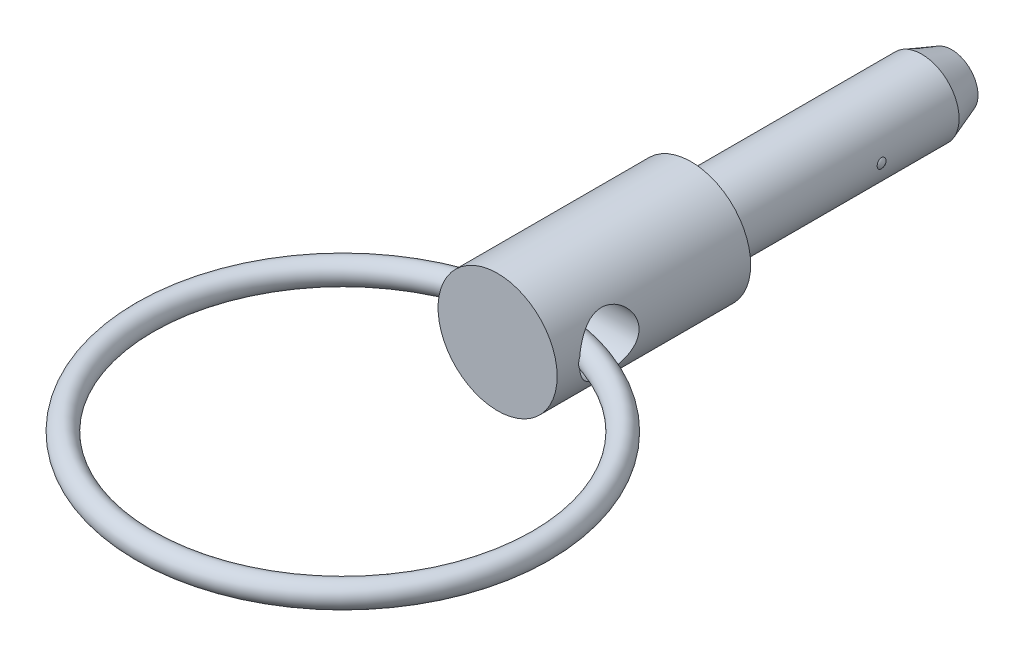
ISO-10303-21;
HEADER;
FILE_DESCRIPTION(('STEP AP214'),'2;1');
FILE_NAME('part.step','',(''),(''),'','','');
FILE_SCHEMA(('AUTOMOTIVE_DESIGN { 1 0 10303 214 1 1 1 1 }'));
ENDSEC;
DATA;
#1=APPLICATION_CONTEXT('core data for automotive mechanical design processes');
#2=APPLICATION_PROTOCOL_DEFINITION('international standard','automotive_design',2000,#1);
#3=PRODUCT_CONTEXT('',#1,'mechanical');
#4=PRODUCT('Part','Part','',(#3));
#5=PRODUCT_RELATED_PRODUCT_CATEGORY('part','',(#4));
#6=PRODUCT_DEFINITION_FORMATION('','',#4);
#7=PRODUCT_DEFINITION_CONTEXT('part definition',#1,'design');
#8=PRODUCT_DEFINITION('design','',#6,#7);
#9=PRODUCT_DEFINITION_SHAPE('','',#8);
#10=(LENGTH_UNIT() NAMED_UNIT(*) SI_UNIT(.MILLI.,.METRE.));
#11=(NAMED_UNIT(*) PLANE_ANGLE_UNIT() SI_UNIT($,.RADIAN.));
#12=(NAMED_UNIT(*) SI_UNIT($,.STERADIAN.) SOLID_ANGLE_UNIT());
#13=UNCERTAINTY_MEASURE_WITH_UNIT(LENGTH_MEASURE(1.E-05),#10,'distance_accuracy_value','');
#14=(GEOMETRIC_REPRESENTATION_CONTEXT(3) GLOBAL_UNCERTAINTY_ASSIGNED_CONTEXT((#13)) GLOBAL_UNIT_ASSIGNED_CONTEXT((#10,
#11,#12)) REPRESENTATION_CONTEXT('',''));
#15=CARTESIAN_POINT('',(0.,0.,0.));
#16=DIRECTION('',(0.,0.,1.));
#17=DIRECTION('',(1.,0.,0.));
#18=AXIS2_PLACEMENT_3D('',#15,#16,#17);
#19=CARTESIAN_POINT('',(0.,0.,14.9758741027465));
#20=DIRECTION('',(0.,0.,1.));
#21=DIRECTION('',(1.,0.,0.));
#22=AXIS2_PLACEMENT_3D('',#19,#20,#21);
#23=CYLINDRICAL_SURFACE('',#22,4.00000000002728);
#24=CARTESIAN_POINT('',(0.,0.,12.9999999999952));
#25=DIRECTION('',(0.,0.,1.));
#26=DIRECTION('',(1.,0.,0.));
#27=AXIS2_PLACEMENT_3D('',#24,#25,#26);
#28=CIRCLE('',#27,4.00000000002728);
#29=CARTESIAN_POINT('',(4.00000000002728,0.,12.9999999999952));
#30=VERTEX_POINT('',#29);
#31=EDGE_CURVE('E66',#30,#30,#28,.T.);
#32=ORIENTED_EDGE('',*,*,#31,.F.);
#33=EDGE_LOOP('',(#32));
#34=FACE_BOUND('',#33,.T.);
#35=CARTESIAN_POINT('',(0.,0.,2.90531487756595E-11));
#36=DIRECTION('',(0.,0.,1.));
#37=DIRECTION('',(1.,0.,0.));
#38=AXIS2_PLACEMENT_3D('',#35,#36,#37);
#39=CIRCLE('',#38,4.00000000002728);
#40=CARTESIAN_POINT('',(4.00000000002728,0.,2.90540174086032E-11));
#41=VERTEX_POINT('',#40);
#42=EDGE_CURVE('E123',#41,#41,#39,.T.);
#43=ORIENTED_EDGE('',*,*,#42,.T.);
#44=EDGE_LOOP('',(#43));
#45=FACE_BOUND('',#44,.T.);
#46=CARTESIAN_POINT('',(3.99005038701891,0.281953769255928,9.92986493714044));
#47=CARTESIAN_POINT('',(3.98710361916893,0.323646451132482,9.94537015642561));
#48=CARTESIAN_POINT('',(3.98358785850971,0.364031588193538,9.96435084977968));
#49=CARTESIAN_POINT('',(3.97580260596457,0.441017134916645,10.008790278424));
#50=CARTESIAN_POINT('',(3.97153248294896,0.477614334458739,10.0342544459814));
#51=CARTESIAN_POINT('',(3.96271650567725,0.545954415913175,10.0909789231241));
#52=CARTESIAN_POINT('',(3.95817071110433,0.577698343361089,10.1222379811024));
#53=CARTESIAN_POINT('',(3.94931125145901,0.635450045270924,10.1896824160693));
#54=CARTESIAN_POINT('',(3.94499753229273,0.661459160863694,10.2258666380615));
#55=CARTESIAN_POINT('',(3.93708131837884,0.707055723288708,10.3020868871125));
#56=CARTESIAN_POINT('',(3.93347801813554,0.726650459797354,10.3421184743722));
#57=CARTESIAN_POINT('',(3.92735611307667,0.759043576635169,10.4249158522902));
#58=CARTESIAN_POINT('',(3.92483759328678,0.7718414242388,10.4676818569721));
#59=CARTESIAN_POINT('',(3.92109281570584,0.790648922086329,10.5555243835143));
#60=CARTESIAN_POINT('',(3.91989028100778,0.796534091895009,10.6006284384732));
#61=CARTESIAN_POINT('',(3.91894269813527,0.801182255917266,10.6912124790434));
#62=CARTESIAN_POINT('',(3.919197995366,0.799943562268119,10.7366925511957));
#63=CARTESIAN_POINT('',(3.92114297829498,0.790356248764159,10.829192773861));
#64=CARTESIAN_POINT('',(3.92290466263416,0.781650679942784,10.8761742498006));
#65=CARTESIAN_POINT('',(3.92772482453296,0.757055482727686,10.9681516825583));
#66=CARTESIAN_POINT('',(3.93078377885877,0.74116321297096,11.0131469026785));
#67=CARTESIAN_POINT('',(3.93806499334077,0.701480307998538,11.1026764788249));
#68=CARTESIAN_POINT('',(3.94234583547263,0.67727451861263,11.1470226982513));
#69=CARTESIAN_POINT('',(3.95147153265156,0.621820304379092,11.2310343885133));
#70=CARTESIAN_POINT('',(3.95631656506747,0.590569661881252,11.2706983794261));
#71=CARTESIAN_POINT('',(3.96601819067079,0.521460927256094,11.3441933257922));
#72=CARTESIAN_POINT('',(3.97087472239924,0.483570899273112,11.3779944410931));
#73=CARTESIAN_POINT('',(3.97994547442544,0.402125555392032,11.4380257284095));
#74=CARTESIAN_POINT('',(3.98416017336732,0.358574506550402,11.4642615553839));
#75=CARTESIAN_POINT('',(3.99101820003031,0.271145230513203,11.5057266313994));
#76=CARTESIAN_POINT('',(3.99376828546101,0.227643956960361,11.5217298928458));
#77=CARTESIAN_POINT('',(3.99785545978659,0.138347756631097,11.5452375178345));
#78=CARTESIAN_POINT('',(3.99919394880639,0.0925551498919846,11.5527503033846));
#79=CARTESIAN_POINT('',(4.00020492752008,0.00564920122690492,11.5584330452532));
#80=CARTESIAN_POINT('',(4.00005022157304,-0.0354012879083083,11.5575719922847));
#81=CARTESIAN_POINT('',(3.99850330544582,-0.116721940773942,11.5488508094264));
#82=CARTESIAN_POINT('',(3.99711125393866,-0.156992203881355,11.5409915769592));
#83=CARTESIAN_POINT('',(3.99330536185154,-0.234470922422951,11.5190218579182));
#84=CARTESIAN_POINT('',(3.99092186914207,-0.271733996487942,11.5050965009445));
#85=CARTESIAN_POINT('',(3.98537855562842,-0.343596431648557,11.4716692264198));
#86=CARTESIAN_POINT('',(3.98221855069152,-0.378195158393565,11.4521659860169));
#87=CARTESIAN_POINT('',(3.97515535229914,-0.446551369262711,11.4066625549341));
#88=CARTESIAN_POINT('',(3.97121432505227,-0.480054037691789,11.380286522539));
#89=CARTESIAN_POINT('',(3.96314004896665,-0.542697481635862,11.3228119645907));
#90=CARTESIAN_POINT('',(3.95900671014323,-0.571836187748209,11.2917112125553));
#91=CARTESIAN_POINT('',(3.95044956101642,-0.628376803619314,11.2218573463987));
#92=CARTESIAN_POINT('',(3.94604615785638,-0.655204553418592,11.1826362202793));
#93=CARTESIAN_POINT('',(3.93791011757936,-0.702452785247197,11.1004353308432));
#94=CARTESIAN_POINT('',(3.93417778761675,-0.722870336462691,11.0574538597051));
#95=CARTESIAN_POINT('',(3.92755557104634,-0.758058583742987,10.9655943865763));
#96=CARTESIAN_POINT('',(3.92474503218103,-0.772320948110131,10.9165145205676));
#97=CARTESIAN_POINT('',(3.92073635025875,-0.792422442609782,10.8165862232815));
#98=CARTESIAN_POINT('',(3.91953811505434,-0.798262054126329,10.765737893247));
#99=CARTESIAN_POINT('',(3.91896964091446,-0.801049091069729,10.6645522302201));
#100=CARTESIAN_POINT('',(3.9195716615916,-0.798131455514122,10.6142190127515));
#101=CARTESIAN_POINT('',(3.92252995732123,-0.783463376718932,10.5149080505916));
#102=CARTESIAN_POINT('',(3.92488547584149,-0.771716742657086,10.4659297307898));
#103=CARTESIAN_POINT('',(3.9308855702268,-0.740520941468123,10.3740211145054));
#104=CARTESIAN_POINT('',(3.93443961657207,-0.721603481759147,10.3309041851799));
#105=CARTESIAN_POINT('',(3.94243966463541,-0.676528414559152,10.2487285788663));
#106=CARTESIAN_POINT('',(3.94688545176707,-0.650372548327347,10.2096689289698));
#107=CARTESIAN_POINT('',(3.95592540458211,-0.592842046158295,10.138445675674));
#108=CARTESIAN_POINT('',(3.96050463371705,-0.561744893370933,10.1060555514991));
#109=CARTESIAN_POINT('',(3.96946431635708,-0.494471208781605,10.0470379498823));
#110=CARTESIAN_POINT('',(3.97384478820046,-0.458295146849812,10.0204099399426));
#111=CARTESIAN_POINT('',(3.9818737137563,-0.382266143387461,9.97385565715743));
#112=CARTESIAN_POINT('',(3.98552868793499,-0.342451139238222,9.95386848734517));
#113=CARTESIAN_POINT('',(3.99175666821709,-0.259975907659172,9.92075319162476));
#114=CARTESIAN_POINT('',(3.9943294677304,-0.217315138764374,9.90762637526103));
#115=CARTESIAN_POINT('',(3.9981192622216,-0.130195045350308,9.88852098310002));
#116=CARTESIAN_POINT('',(3.99933102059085,-0.0857294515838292,9.88257000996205));
#117=CARTESIAN_POINT('',(4.00024701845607,0.0035637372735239,9.87805708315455));
#118=CARTESIAN_POINT('',(3.9999525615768,0.0483909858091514,9.8794887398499));
#119=CARTESIAN_POINT('',(3.99817522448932,0.12508250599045,9.88829599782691));
#120=CARTESIAN_POINT('',(3.9970365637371,0.157163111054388,9.8939529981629));
#121=CARTESIAN_POINT('',(3.99404982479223,0.220379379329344,9.90907748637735));
#122=CARTESIAN_POINT('',(3.9922017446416,0.251515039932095,9.91854498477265));
#123=CARTESIAN_POINT('',(3.99005038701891,0.281953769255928,9.92986493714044));
#124=B_SPLINE_CURVE_WITH_KNOTS('',3,(#46,#47,#48,#49,#50,#51,#52,#53,#54,#55,#56,#57,#58,#59,
#60,#61,#62,#63,#64,#65,#66,#67,#68,#69,#70,#71,#72,#73,#74,#75,#76,#77,#78,#79,#80,#81,#82,#83,
#84,#85,#86,#87,#88,#89,#90,#91,#92,#93,#94,#95,#96,#97,#98,#99,#100,#101,#102,#103,#104,#105,
#106,#107,#108,#109,#110,#111,#112,#113,#114,#115,#116,#117,#118,#119,#120,#121,#122,#123),
.UNSPECIFIED.,.T.,.F.,(4,2,2,2,2,2,2,2,2,2,2,2,2,2,2,2,2,2,2,2,2,2,2,2,2,2,2,2,2,2,2,2,2,2,2,2,
2,2,4),(0.,0.133622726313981,0.267357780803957,0.401063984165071,0.534738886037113,
0.668261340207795,0.801794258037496,0.937696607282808,1.07363115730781,1.21645096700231,
1.35932331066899,1.5107314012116,1.66218722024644,1.81439261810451,1.96648394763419,
2.1049852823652,2.24334911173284,2.36591145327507,2.488458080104,2.6075014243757,
2.72657302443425,2.85451767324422,2.98252280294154,3.12508196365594,3.26770620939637,
3.42053145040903,3.57334795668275,3.72382188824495,3.87423093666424,4.01516707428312,
4.15606933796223,4.29082406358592,4.42556633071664,4.55903651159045,4.69253216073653,
4.82653969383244,4.96043126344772,5.05798542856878,5.15553986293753),.UNSPECIFIED.);
#125=CARTESIAN_POINT('',(3.98515545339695,0.344290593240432,11.4701431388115));
#126=VERTEX_POINT('',#125);
#127=CARTESIAN_POINT('',(3.98515545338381,-0.344290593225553,11.4701431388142));
#128=VERTEX_POINT('',#127);
#129=EDGE_CURVE('E51',#126,#128,#124,.T.);
#130=ORIENTED_EDGE('',*,*,#129,.F.);
#131=CARTESIAN_POINT('',(4.00000000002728,0.,7.5));
#132=CARTESIAN_POINT('',(3.9999942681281,0.105143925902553,7.50000660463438));
#133=CARTESIAN_POINT('',(3.99580982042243,0.210413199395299,7.50834014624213));
#134=CARTESIAN_POINT('',(3.97948312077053,0.417840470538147,7.54130576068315));
#135=CARTESIAN_POINT('',(3.96732575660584,0.519992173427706,7.56596878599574));
#136=CARTESIAN_POINT('',(3.93632558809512,0.717867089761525,7.63038761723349));
#137=CARTESIAN_POINT('',(3.91750878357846,0.813613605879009,7.67008476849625));
#138=CARTESIAN_POINT('',(3.87491553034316,0.996945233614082,7.76314124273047));
#139=CARTESIAN_POINT('',(3.85113947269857,1.08453098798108,7.81649948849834));
#140=CARTESIAN_POINT('',(3.79912516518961,1.25501563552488,7.93903449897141));
#141=CARTESIAN_POINT('',(3.7707039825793,1.33731042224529,8.00897295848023));
#142=CARTESIAN_POINT('',(3.71319940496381,1.48955888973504,8.16104295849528));
#143=CARTESIAN_POINT('',(3.68411552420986,1.55950316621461,8.24318370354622));
#144=CARTESIAN_POINT('',(3.6259790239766,1.6905040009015,8.42496669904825));
#145=CARTESIAN_POINT('',(3.59710373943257,1.75045067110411,8.52547219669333));
#146=CARTESIAN_POINT('',(3.54571957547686,1.852336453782,8.73673467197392));
#147=CARTESIAN_POINT('',(3.5232061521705,1.89428842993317,8.84748425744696));
#148=CARTESIAN_POINT('',(3.48915734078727,1.95626488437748,9.06933021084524));
#149=CARTESIAN_POINT('',(3.47704543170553,1.9774517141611,9.18000890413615));
#150=CARTESIAN_POINT('',(3.46363779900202,2.00085398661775,9.40395767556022));
#151=CARTESIAN_POINT('',(3.46233138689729,2.00308817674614,9.51722508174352));
#152=CARTESIAN_POINT('',(3.4702186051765,1.98937457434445,9.72857204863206));
#153=CARTESIAN_POINT('',(3.47817527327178,1.97556911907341,9.82684806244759));
#154=CARTESIAN_POINT('',(3.50152457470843,1.93387969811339,10.0194438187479));
#155=CARTESIAN_POINT('',(3.51691957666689,1.90599124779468,10.1137622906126));
#156=CARTESIAN_POINT('',(3.55374952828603,1.83641956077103,10.2984582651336));
#157=CARTESIAN_POINT('',(3.57531681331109,1.79443013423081,10.388692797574));
#158=CARTESIAN_POINT('',(3.62206808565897,1.69808337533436,10.5612685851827));
#159=CARTESIAN_POINT('',(3.64725369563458,1.64372048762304,10.6436062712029));
#160=CARTESIAN_POINT('',(3.70226315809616,1.51613210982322,10.8090425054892));
#161=CARTESIAN_POINT('',(3.73227020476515,1.441388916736,10.890913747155));
#162=CARTESIAN_POINT('',(3.79095246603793,1.2791111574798,11.0414708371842));
#163=CARTESIAN_POINT('',(3.81962703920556,1.19157051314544,11.1101503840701));
#164=CARTESIAN_POINT('',(3.87403974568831,1.00103301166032,11.2353713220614));
#165=CARTESIAN_POINT('',(3.89957968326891,0.897507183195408,11.2912009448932));
#166=CARTESIAN_POINT('',(3.94315762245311,0.680932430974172,11.3841940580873));
#167=CARTESIAN_POINT('',(3.96120157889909,0.567891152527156,11.4213723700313));
#168=CARTESIAN_POINT('',(3.98648667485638,0.345532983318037,11.4729508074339));
#169=CARTESIAN_POINT('',(3.99449876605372,0.236683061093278,11.488982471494));
#170=CARTESIAN_POINT('',(4.00146026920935,0.0175591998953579,11.502929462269));
#171=CARTESIAN_POINT('',(4.00041397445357,-0.0927140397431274,11.5008533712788));
#172=CARTESIAN_POINT('',(3.98982384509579,-0.302465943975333,11.479586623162));
#173=CARTESIAN_POINT('',(3.98094491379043,-0.402118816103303,11.4617349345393));
#174=CARTESIAN_POINT('',(3.95644342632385,-0.596813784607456,11.4115238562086));
#175=CARTESIAN_POINT('',(3.94082012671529,-0.691855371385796,11.3791628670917));
#176=CARTESIAN_POINT('',(3.90368502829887,-0.877777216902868,11.3000030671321));
#177=CARTESIAN_POINT('',(3.88201763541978,-0.968460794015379,11.2528178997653));
#178=CARTESIAN_POINT('',(3.83487948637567,-1.14092272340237,11.1457849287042));
#179=CARTESIAN_POINT('',(3.80940711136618,-1.22269725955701,11.0859317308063));
#180=CARTESIAN_POINT('',(3.75416442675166,-1.38353537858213,10.948479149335));
#181=CARTESIAN_POINT('',(3.72421769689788,-1.46154415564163,10.8697142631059));
#182=CARTESIAN_POINT('',(3.66524783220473,-1.60371264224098,10.7001496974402));
#183=CARTESIAN_POINT('',(3.63622534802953,-1.66786277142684,10.6093417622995));
#184=CARTESIAN_POINT('',(3.58102384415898,-1.7834158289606,10.412712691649));
#185=CARTESIAN_POINT('',(3.55505059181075,-1.83405099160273,10.306377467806));
#186=CARTESIAN_POINT('',(3.51148144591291,-1.91616565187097,10.0849798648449));
#187=CARTESIAN_POINT('',(3.49387476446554,-1.94766983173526,9.96992894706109));
#188=CARTESIAN_POINT('',(3.47123002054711,-1.98772337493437,9.74617955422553));
#189=CARTESIAN_POINT('',(3.46514766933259,-1.99818599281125,9.6379314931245));
#190=CARTESIAN_POINT('',(3.46330709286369,-2.00137830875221,9.42110586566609));
#191=CARTESIAN_POINT('',(3.46754439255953,-1.99411569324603,9.31252846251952));
#192=CARTESIAN_POINT('',(3.48475724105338,-1.96385225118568,9.10903299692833));
#193=CARTESIAN_POINT('',(3.49686188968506,-1.94241662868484,9.01379905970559));
#194=CARTESIAN_POINT('',(3.52742032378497,-1.88635071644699,8.8283837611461));
#195=CARTESIAN_POINT('',(3.54587615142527,-1.85171618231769,8.73820403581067));
#196=CARTESIAN_POINT('',(3.58857060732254,-1.76763149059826,8.55875029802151));
#197=CARTESIAN_POINT('',(3.61311444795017,-1.71734227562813,8.46994419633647));
#198=CARTESIAN_POINT('',(3.66470663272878,-1.60430194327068,8.30145092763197));
#199=CARTESIAN_POINT('',(3.69175627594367,-1.54154434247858,8.22176853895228));
#200=CARTESIAN_POINT('',(3.74924646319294,-1.3964066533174,8.06371603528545));
#201=CARTESIAN_POINT('',(3.77969966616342,-1.31256884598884,7.98668179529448));
#202=CARTESIAN_POINT('',(3.83755504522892,-1.13230961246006,7.84747403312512));
#203=CARTESIAN_POINT('',(3.86495557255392,-1.03588144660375,7.78530852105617));
#204=CARTESIAN_POINT('',(3.91396019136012,-0.831863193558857,7.67752727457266));
#205=CARTESIAN_POINT('',(3.93552192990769,-0.724199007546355,7.63203166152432));
#206=CARTESIAN_POINT('',(3.97002682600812,-0.501484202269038,7.56038366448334));
#207=CARTESIAN_POINT('',(3.98299446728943,-0.386455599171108,7.53417630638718));
#208=CARTESIAN_POINT('',(3.9939092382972,-0.225203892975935,7.51220517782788));
#209=CARTESIAN_POINT('',(3.99618730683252,-0.180323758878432,7.50763471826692));
#210=CARTESIAN_POINT('',(3.99923393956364,-0.0903034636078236,7.50153066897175));
#211=CARTESIAN_POINT('',(4.0000024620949,-0.0451632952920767,7.49999716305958));
#212=CARTESIAN_POINT('',(4.00000000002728,0.,7.5));
#213=B_SPLINE_CURVE_WITH_KNOTS('',3,(#131,#132,#133,#134,#135,#136,#137,#138,#139,#140,#141,
#142,#143,#144,#145,#146,#147,#148,#149,#150,#151,#152,#153,#154,#155,#156,#157,#158,#159,#160,
#161,#162,#163,#164,#165,#166,#167,#168,#169,#170,#171,#172,#173,#174,#175,#176,#177,#178,#179,
#180,#181,#182,#183,#184,#185,#186,#187,#188,#189,#190,#191,#192,#193,#194,#195,#196,#197,#198,
#199,#200,#201,#202,#203,#204,#205,#206,#207,#208,#209,#210,#211,#212),.UNSPECIFIED.,.T.,.F.,(4,
2,2,2,2,2,2,2,2,2,2,2,2,2,2,2,2,2,2,2,2,2,2,2,2,2,2,2,2,2,2,2,2,2,2,2,2,2,2,2,4),(0.,
0.315248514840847,0.631096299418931,0.94572431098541,1.26032752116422,1.59396351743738,
1.92785247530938,2.28763452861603,2.64715895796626,2.98516024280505,3.3228271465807,
3.62011424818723,3.91749607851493,4.22180480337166,4.52625042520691,4.86929882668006,
5.21251069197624,5.57166044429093,5.93052433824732,6.25966580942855,6.58865129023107,
6.89213813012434,7.19565843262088,7.50785712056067,7.82018901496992,8.16319221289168,
8.5064317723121,8.86629364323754,9.2256902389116,9.55058615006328,9.87534119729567,
10.1691586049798,10.4630705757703,10.7767291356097,11.0905512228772,11.4425048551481,
11.7946476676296,12.1492802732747,12.5028981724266,12.6383056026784,12.7737167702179),.UNSPECIFIED.);
#214=EDGE_CURVE('E57',#128,#126,#213,.T.);
#215=ORIENTED_EDGE('',*,*,#214,.F.);
#216=EDGE_LOOP('',(#130,#215));
#217=FACE_BOUND('',#216,.T.);
#218=CARTESIAN_POINT('',(-3.99005038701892,0.281953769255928,9.92986493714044));
#219=CARTESIAN_POINT('',(-3.99300741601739,0.24009511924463,9.91430139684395));
#220=CARTESIAN_POINT('',(-3.99539394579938,0.196873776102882,9.90222423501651));
#221=CARTESIAN_POINT('',(-3.99875840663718,0.108949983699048,9.88535960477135));
#222=CARTESIAN_POINT('',(-3.99973502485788,0.0642461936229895,9.88057893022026));
#223=CARTESIAN_POINT('',(-4.00017032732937,-0.0253314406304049,9.87843698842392));
#224=CARTESIAN_POINT('',(-3.99962961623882,-0.0702052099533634,9.88107276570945));
#225=CARTESIAN_POINT('',(-3.99709040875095,-0.158855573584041,9.89369477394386));
#226=CARTESIAN_POINT('',(-3.99509218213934,-0.202632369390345,9.90367964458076));
#227=CARTESIAN_POINT('',(-3.9898570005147,-0.287863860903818,9.93075746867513));
#228=CARTESIAN_POINT('',(-3.98661975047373,-0.329318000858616,9.94785211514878));
#229=CARTESIAN_POINT('',(-3.97926488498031,-0.408707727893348,9.98872052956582));
#230=CARTESIAN_POINT('',(-3.97514726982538,-0.446643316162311,10.0124942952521));
#231=CARTESIAN_POINT('',(-3.96650501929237,-0.517804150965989,10.0660180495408));
#232=CARTESIAN_POINT('',(-3.96198162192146,-0.551042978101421,10.0957501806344));
#233=CARTESIAN_POINT('',(-3.95302385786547,-0.612008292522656,10.1604189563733));
#234=CARTESIAN_POINT('',(-3.9485894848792,-0.639735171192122,10.1953552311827));
#235=CARTESIAN_POINT('',(-3.94031345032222,-0.68887706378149,10.2693392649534));
#236=CARTESIAN_POINT('',(-3.93647024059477,-0.710308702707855,10.3083758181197));
#237=CARTESIAN_POINT('',(-3.92977370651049,-0.746470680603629,10.3895111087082));
#238=CARTESIAN_POINT('',(-3.92692040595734,-0.761200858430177,10.431609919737));
#239=CARTESIAN_POINT('',(-3.92245555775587,-0.783887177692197,10.5182713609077));
#240=CARTESIAN_POINT('',(-3.9208616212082,-0.791747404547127,10.5628599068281));
#241=CARTESIAN_POINT('',(-3.91911143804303,-0.80036516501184,10.6527409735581));
#242=CARTESIAN_POINT('',(-3.91895550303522,-0.801121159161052,10.698033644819));
#243=CARTESIAN_POINT('',(-3.92007796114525,-0.795611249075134,10.7902748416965));
#244=CARTESIAN_POINT('',(-3.92142316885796,-0.789018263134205,10.837202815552));
#245=CARTESIAN_POINT('',(-3.92546548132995,-0.768652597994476,10.9294151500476));
#246=CARTESIAN_POINT('',(-3.92816306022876,-0.754877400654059,10.9746989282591));
#247=CARTESIAN_POINT('',(-3.93479992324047,-0.719508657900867,11.0652695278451));
#248=CARTESIAN_POINT('',(-3.93880557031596,-0.697485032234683,11.1103840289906));
#249=CARTESIAN_POINT('',(-3.9475206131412,-0.64633762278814,11.196342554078));
#250=CARTESIAN_POINT('',(-3.95223026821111,-0.617211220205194,11.2371849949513));
#251=CARTESIAN_POINT('',(-3.96188534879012,-0.551879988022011,11.3139586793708));
#252=CARTESIAN_POINT('',(-3.96683340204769,-0.515564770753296,11.349796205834));
#253=CARTESIAN_POINT('',(-3.97625988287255,-0.436941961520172,11.414255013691));
#254=CARTESIAN_POINT('',(-3.9807385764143,-0.394637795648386,11.4428803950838));
#255=CARTESIAN_POINT('',(-3.98829005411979,-0.308636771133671,11.4895001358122));
#256=CARTESIAN_POINT('',(-3.9914449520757,-0.265302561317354,11.5081469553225));
#257=CARTESIAN_POINT('',(-3.99638413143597,-0.175817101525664,11.5368761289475));
#258=CARTESIAN_POINT('',(-3.99816989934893,-0.129668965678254,11.5469677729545));
#259=CARTESIAN_POINT('',(-3.99999419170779,-0.0417967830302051,11.5572584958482));
#260=CARTESIAN_POINT('',(-4.0002143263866,-0.000194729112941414,11.5584860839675));
#261=CARTESIAN_POINT('',(-3.99936155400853,0.0825703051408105,11.5536924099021));
#262=CARTESIAN_POINT('',(-3.99828892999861,0.123733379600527,11.5476727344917));
#263=CARTESIAN_POINT('',(-3.99505363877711,0.202575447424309,11.5291543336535));
#264=CARTESIAN_POINT('',(-3.99294152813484,0.240327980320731,11.5169554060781));
#265=CARTESIAN_POINT('',(-3.98787194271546,0.313401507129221,11.4868260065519));
#266=CARTESIAN_POINT('',(-3.98491430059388,0.348722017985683,11.4688943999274));
#267=CARTESIAN_POINT('',(-3.97822434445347,0.418368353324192,11.4267056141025));
#268=CARTESIAN_POINT('',(-3.97445500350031,0.452491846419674,11.4021214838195));
#269=CARTESIAN_POINT('',(-3.96662805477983,0.51663139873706,11.3481231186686));
#270=CARTESIAN_POINT('',(-3.96257031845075,0.546645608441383,11.3187067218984));
#271=CARTESIAN_POINT('',(-3.9540631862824,0.605276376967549,11.2522992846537));
#272=CARTESIAN_POINT('',(-3.94962143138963,0.633350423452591,11.214827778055));
#273=CARTESIAN_POINT('',(-3.94127015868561,0.683399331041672,11.135950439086));
#274=CARTESIAN_POINT('',(-3.93736090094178,0.70537121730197,11.0945427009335));
#275=CARTESIAN_POINT('',(-3.93019522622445,0.744305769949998,11.0052774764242));
#276=CARTESIAN_POINT('',(-3.9270182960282,0.760712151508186,10.9571694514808));
#277=CARTESIAN_POINT('',(-3.92216984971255,0.785329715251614,10.8588172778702));
#278=CARTESIAN_POINT('',(-3.92049838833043,0.793540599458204,10.8085730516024));
#279=CARTESIAN_POINT('',(-3.91892501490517,0.801276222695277,10.7075574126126));
#280=CARTESIAN_POINT('',(-3.91901674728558,0.800832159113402,10.6567885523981));
#281=CARTESIAN_POINT('',(-3.92100845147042,0.791023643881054,10.5561554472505));
#282=CARTESIAN_POINT('',(-3.92290760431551,0.7816632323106,10.5062908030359));
#283=CARTESIAN_POINT('',(-3.92814611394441,0.754877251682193,10.4121456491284));
#284=CARTESIAN_POINT('',(-3.93139064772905,0.737977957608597,10.3677100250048));
#285=CARTESIAN_POINT('',(-3.93892368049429,0.696648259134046,10.2825763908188));
#286=CARTESIAN_POINT('',(-3.94321208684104,0.672218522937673,10.2418780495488));
#287=CARTESIAN_POINT('',(-3.95208501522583,0.617853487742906,10.1674080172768));
#288=CARTESIAN_POINT('',(-3.95664517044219,0.588241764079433,10.1333964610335));
#289=CARTESIAN_POINT('',(-3.96570971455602,0.523645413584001,10.0709664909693));
#290=CARTESIAN_POINT('',(-3.97021415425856,0.488666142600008,10.0425425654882));
#291=CARTESIAN_POINT('',(-3.97742706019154,0.425180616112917,9.99940040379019));
#292=CARTESIAN_POINT('',(-3.98027692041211,0.397749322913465,9.98310007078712));
#293=CARTESIAN_POINT('',(-3.98553180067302,0.341095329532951,9.95389443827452));
#294=CARTESIAN_POINT('',(-3.98793682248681,0.311872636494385,9.94098912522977));
#295=CARTESIAN_POINT('',(-3.99005038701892,0.281953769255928,9.92986493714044));
#296=B_SPLINE_CURVE_WITH_KNOTS('',3,(#218,#219,#220,#221,#222,#223,#224,#225,#226,#227,#228,
#229,#230,#231,#232,#233,#234,#235,#236,#237,#238,#239,#240,#241,#242,#243,#244,#245,#246,#247,
#248,#249,#250,#251,#252,#253,#254,#255,#256,#257,#258,#259,#260,#261,#262,#263,#264,#265,#266,
#267,#268,#269,#270,#271,#272,#273,#274,#275,#276,#277,#278,#279,#280,#281,#282,#283,#284,#285,
#286,#287,#288,#289,#290,#291,#292,#293,#294,#295),.UNSPECIFIED.,.T.,.F.,(4,2,2,2,2,2,2,2,2,2,2,
2,2,2,2,2,2,2,2,2,2,2,2,2,2,2,2,2,2,2,2,2,2,2,2,2,2,2,4),(0.,0.134152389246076,
0.268429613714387,0.402653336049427,0.536852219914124,0.671083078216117,0.805313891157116,
0.939148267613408,1.07297313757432,1.20644134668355,1.3399127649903,1.47521916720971,
1.61055488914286,1.75216328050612,1.89382135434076,2.04422271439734,2.19467961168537,
2.34765655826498,2.50054634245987,2.64157513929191,2.7824505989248,2.90667081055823,
3.03086382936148,3.14953805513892,3.26823578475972,3.39440010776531,3.52062102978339,
3.66112536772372,3.80169808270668,3.95376166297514,4.10583077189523,4.25735183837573,
4.40880428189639,4.55102684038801,4.6932367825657,4.82856596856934,4.96376098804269,
5.05964806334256,5.15553475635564),.UNSPECIFIED.);
#297=CARTESIAN_POINT('',(-3.98515545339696,-0.344290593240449,11.4701431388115));
#298=VERTEX_POINT('',#297);
#299=CARTESIAN_POINT('',(-3.98515545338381,0.344290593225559,11.4701431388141));
#300=VERTEX_POINT('',#299);
#301=EDGE_CURVE('E49',#298,#300,#296,.T.);
#302=ORIENTED_EDGE('',*,*,#301,.F.);
#303=CARTESIAN_POINT('',(-3.46410161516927,2.,9.5));
#304=CARTESIAN_POINT('',(-3.46411185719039,1.99999158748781,9.39578679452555));
#305=CARTESIAN_POINT('',(-3.46887633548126,1.99179963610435,9.29143782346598));
#306=CARTESIAN_POINT('',(-3.48724701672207,1.95944672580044,9.08594482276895));
#307=CARTESIAN_POINT('',(-3.50087179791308,1.93525221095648,8.98480799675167));
#308=CARTESIAN_POINT('',(-3.53498701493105,1.87219981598,8.78909684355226));
#309=CARTESIAN_POINT('',(-3.5554408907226,1.83341988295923,8.69449074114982));
#310=CARTESIAN_POINT('',(-3.60085327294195,1.74253507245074,8.51315154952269));
#311=CARTESIAN_POINT('',(-3.62581202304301,1.6904294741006,8.42641888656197));
#312=CARTESIAN_POINT('',(-3.679937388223,1.56933307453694,8.25538855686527));
#313=CARTESIAN_POINT('',(-3.70928127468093,1.49930407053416,8.1718817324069));
#314=CARTESIAN_POINT('',(-3.76743965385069,1.34650761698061,8.01718321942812));
#315=CARTESIAN_POINT('',(-3.79625387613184,1.26373385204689,7.94599767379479));
#316=CARTESIAN_POINT('',(-3.8524295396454,1.080979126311,7.81326569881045));
#317=CARTESIAN_POINT('',(-3.879562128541,0.980214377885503,7.75269246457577));
#318=CARTESIAN_POINT('',(-3.92701512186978,0.768314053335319,7.64971829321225));
#319=CARTESIAN_POINT('',(-3.94733982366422,0.657185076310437,7.60730588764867));
#320=CARTESIAN_POINT('',(-3.97760922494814,0.436089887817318,7.54499067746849));
#321=CARTESIAN_POINT('',(-3.98818960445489,0.326603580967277,7.52370094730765));
#322=CARTESIAN_POINT('',(-4.00015167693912,0.105141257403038,7.49966776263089));
#323=CARTESIAN_POINT('',(-4.00153893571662,-0.00683321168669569,7.49691308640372));
#324=CARTESIAN_POINT('',(-3.99525963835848,-0.21966504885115,7.50949334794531));
#325=CARTESIAN_POINT('',(-3.98836991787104,-0.320642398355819,7.5232760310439));
#326=CARTESIAN_POINT('',(-3.96748490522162,-0.51862754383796,7.56576168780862));
#327=CARTESIAN_POINT('',(-3.95348908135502,-0.615635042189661,7.59446577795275));
#328=CARTESIAN_POINT('',(-3.91943166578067,-0.804618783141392,7.66616513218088));
#329=CARTESIAN_POINT('',(-3.89928883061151,-0.896506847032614,7.70935262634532));
#330=CARTESIAN_POINT('',(-3.85475291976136,-1.07195360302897,7.80852683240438));
#331=CARTESIAN_POINT('',(-3.83035832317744,-1.15550929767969,7.86451812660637));
#332=CARTESIAN_POINT('',(-3.77688788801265,-1.32034732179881,7.99379070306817));
#333=CARTESIAN_POINT('',(-3.74758751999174,-1.40066815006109,8.06820605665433));
#334=CARTESIAN_POINT('',(-3.68908681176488,-1.54820874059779,8.22917944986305));
#335=CARTESIAN_POINT('',(-3.65988656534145,-1.6154184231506,8.31574674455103));
#336=CARTESIAN_POINT('',(-3.60288312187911,-1.73901066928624,8.50529638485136));
#337=CARTESIAN_POINT('',(-3.57528639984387,-1.79443462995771,8.60897204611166));
#338=CARTESIAN_POINT('',(-3.52750900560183,-1.88663822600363,8.82587534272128));
#339=CARTESIAN_POINT('',(-3.50732060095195,-1.92343731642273,8.9390928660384));
#340=CARTESIAN_POINT('',(-3.47889271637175,-1.97436042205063,9.1624290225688));
#341=CARTESIAN_POINT('',(-3.46983311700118,-1.99005024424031,9.27208223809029));
#342=CARTESIAN_POINT('',(-3.46235838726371,-2.00303389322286,9.49280268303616));
#343=CARTESIAN_POINT('',(-3.46393573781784,-2.00034071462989,9.60386885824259));
#344=CARTESIAN_POINT('',(-3.47668673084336,-1.97807208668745,9.81130783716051));
#345=CARTESIAN_POINT('',(-3.48679175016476,-1.96037563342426,9.90795890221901));
#346=CARTESIAN_POINT('',(-3.51388043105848,-1.91139256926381,10.0967355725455));
#347=CARTESIAN_POINT('',(-3.5308663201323,-1.88010155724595,10.1888597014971));
#348=CARTESIAN_POINT('',(-3.57072444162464,-1.80329517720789,10.370822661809));
#349=CARTESIAN_POINT('',(-3.59383286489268,-1.75718812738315,10.46035803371));
#350=CARTESIAN_POINT('',(-3.64312238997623,-1.65257412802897,10.6309385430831));
#351=CARTESIAN_POINT('',(-3.6693050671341,-1.59406080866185,10.7119792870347));
#352=CARTESIAN_POINT('',(-3.72575996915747,-1.45767433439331,10.8739575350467));
#353=CARTESIAN_POINT('',(-3.75613166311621,-1.37829054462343,10.9535943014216));
#354=CARTESIAN_POINT('',(-3.81468469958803,-1.20680899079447,11.0988244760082));
#355=CARTESIAN_POINT('',(-3.84286530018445,-1.11470694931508,11.1644131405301));
#356=CARTESIAN_POINT('',(-3.89482723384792,-0.917070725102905,11.2811474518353));
#357=CARTESIAN_POINT('',(-3.91847283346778,-0.811246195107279,11.3318662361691));
#358=CARTESIAN_POINT('',(-3.95766709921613,-0.591044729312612,11.4142758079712));
#359=CARTESIAN_POINT('',(-3.97322287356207,-0.476675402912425,11.4459833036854));
#360=CARTESIAN_POINT('',(-3.99335016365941,-0.253959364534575,11.4867371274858));
#361=CARTESIAN_POINT('',(-3.99879855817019,-0.146022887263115,11.4975957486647));
#362=CARTESIAN_POINT('',(-4.00084260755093,0.0702519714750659,11.5016865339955));
#363=CARTESIAN_POINT('',(-3.99744136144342,0.178590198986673,11.4949248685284));
#364=CARTESIAN_POINT('',(-3.98267937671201,0.385075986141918,11.4651671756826));
#365=CARTESIAN_POINT('',(-3.97185789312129,0.483424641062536,11.4432702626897));
#366=CARTESIAN_POINT('',(-3.94384187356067,0.674891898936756,11.3853460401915));
#367=CARTESIAN_POINT('',(-3.92664642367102,0.768009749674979,11.3493167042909));
#368=CARTESIAN_POINT('',(-3.88651861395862,0.950846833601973,11.2625457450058));
#369=CARTESIAN_POINT('',(-3.86337234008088,1.04025036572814,11.211240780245));
#370=CARTESIAN_POINT('',(-3.81376266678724,1.20954920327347,11.096084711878));
#371=CARTESIAN_POINT('',(-3.78729774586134,1.28944011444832,11.0322278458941));
#372=CARTESIAN_POINT('',(-3.73057218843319,1.44582833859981,10.8864033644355));
#373=CARTESIAN_POINT('',(-3.70019591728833,1.52119665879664,10.8032658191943));
#374=CARTESIAN_POINT('',(-3.64126158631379,1.65732528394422,10.6251077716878));
#375=CARTESIAN_POINT('',(-3.61270515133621,1.71807266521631,10.530076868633));
#376=CARTESIAN_POINT('',(-3.55999186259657,1.82486714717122,10.3266911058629));
#377=CARTESIAN_POINT('',(-3.53600256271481,1.8703890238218,10.2180100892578));
#378=CARTESIAN_POINT('',(-3.50696218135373,1.92395929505,10.0494218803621));
#379=CARTESIAN_POINT('',(-3.49844389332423,1.93935666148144,9.99235217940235));
#380=CARTESIAN_POINT('',(-3.48406059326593,1.96508069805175,9.87676744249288));
#381=CARTESIAN_POINT('',(-3.47819372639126,1.97541091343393,9.81825344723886));
#382=CARTESIAN_POINT('',(-3.47059023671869,1.9887293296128,9.71639921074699));
#383=CARTESIAN_POINT('',(-3.46816389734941,1.99295091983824,9.67326694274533));
#384=CARTESIAN_POINT('',(-3.46491740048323,1.99858810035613,9.5867643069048));
#385=CARTESIAN_POINT('',(-3.46409735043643,2.00000350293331,9.54339392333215));
#386=CARTESIAN_POINT('',(-3.46410161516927,2.,9.5));
#387=B_SPLINE_CURVE_WITH_KNOTS('',3,(#303,#304,#305,#306,#307,#308,#309,#310,#311,#312,#313,
#314,#315,#316,#317,#318,#319,#320,#321,#322,#323,#324,#325,#326,#327,#328,#329,#330,#331,#332,
#333,#334,#335,#336,#337,#338,#339,#340,#341,#342,#343,#344,#345,#346,#347,#348,#349,#350,#351,
#352,#353,#354,#355,#356,#357,#358,#359,#360,#361,#362,#363,#364,#365,#366,#367,#368,#369,#370,
#371,#372,#373,#374,#375,#376,#377,#378,#379,#380,#381,#382,#383,#384,#385,#386),.UNSPECIFIED.,
.T.,.F.,(4,2,2,2,2,2,2,2,2,2,2,2,2,2,2,2,2,2,2,2,2,2,2,2,2,2,2,2,2,2,2,2,2,2,2,2,2,2,2,2,2,4),
(0.,0.312464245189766,0.625585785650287,0.937057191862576,1.24854545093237,1.58572462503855,
1.92307142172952,2.283157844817,2.64301653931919,2.97726969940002,3.31132047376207,
3.61632194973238,3.92134625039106,4.23059069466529,4.53994598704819,4.87854382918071,
5.21740096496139,5.57777683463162,5.93777548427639,6.26924581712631,6.60048186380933,
6.89548366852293,7.19058104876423,7.49934592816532,7.80826972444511,8.15613487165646,
8.50411729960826,8.8612836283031,9.21813559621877,9.54224540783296,9.86624173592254,
10.1688884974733,10.4715786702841,10.7872150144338,11.1029966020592,11.4502048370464,
11.7977188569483,12.1562149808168,12.3351395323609,12.513938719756,12.6440387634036,
12.7741475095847),.UNSPECIFIED.);
#388=EDGE_CURVE('E54',#300,#298,#387,.T.);
#389=ORIENTED_EDGE('',*,*,#388,.F.);
#390=EDGE_LOOP('',(#302,#389));
#391=FACE_BOUND('',#390,.T.);
#392=ADVANCED_FACE('F14',(#34,#45,#217,#391),#23,.T.);
#393=CARTESIAN_POINT('',(-5.,0.,9.5));
#394=DIRECTION('',(1.,0.,0.));
#395=DIRECTION('',(0.,1.,0.));
#396=AXIS2_PLACEMENT_3D('',#393,#394,#395);
#397=CYLINDRICAL_SURFACE('',#396,2.);
#398=ORIENTED_EDGE('',*,*,#388,.T.);
#399=CARTESIAN_POINT('',(-4.01108315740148,-0.369511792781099,11.4655688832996));
#400=CARTESIAN_POINT('',(-3.99021138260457,-0.350083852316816,11.4692147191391));
#401=CARTESIAN_POINT('',(-3.97024619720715,-0.32951681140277,11.4727888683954));
#402=CARTESIAN_POINT('',(-3.93275440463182,-0.28567846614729,11.4796199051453));
#403=CARTESIAN_POINT('',(-3.91527020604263,-0.262370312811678,11.4828710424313));
#404=CARTESIAN_POINT('',(-3.88395406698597,-0.213038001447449,11.4887768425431));
#405=CARTESIAN_POINT('',(-3.87014971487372,-0.186995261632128,11.4914269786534));
#406=CARTESIAN_POINT('',(-3.84773626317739,-0.132819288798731,11.4957673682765));
#407=CARTESIAN_POINT('',(-3.83909292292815,-0.104701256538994,11.4974639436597));
#408=CARTESIAN_POINT('',(-3.82934402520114,-0.054244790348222,11.4993828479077));
#409=CARTESIAN_POINT('',(-3.8269137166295,-0.0321704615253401,11.499863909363));
#410=CARTESIAN_POINT('',(-3.82579163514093,0.0120958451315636,11.500085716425));
#411=CARTESIAN_POINT('',(-3.82710196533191,0.0342878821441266,11.4998260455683));
#412=CARTESIAN_POINT('',(-3.83333881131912,0.0780566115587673,11.498595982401));
#413=CARTESIAN_POINT('',(-3.83825432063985,0.0996349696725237,11.4976277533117));
#414=CARTESIAN_POINT('',(-3.8512832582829,0.141760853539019,11.4950816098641));
#415=CARTESIAN_POINT('',(-3.85939921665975,0.162307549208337,11.4935032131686));
#416=CARTESIAN_POINT('',(-3.88251041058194,0.210921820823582,11.489056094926));
#417=CARTESIAN_POINT('',(-3.89895987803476,0.2382710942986,11.4859257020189));
#418=CARTESIAN_POINT('',(-3.93589373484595,0.289965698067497,11.4790416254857));
#419=CARTESIAN_POINT('',(-3.95638428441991,0.314306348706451,11.4752869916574));
#420=CARTESIAN_POINT('',(-3.98891907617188,0.348315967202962,11.4694667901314));
#421=CARTESIAN_POINT('',(-3.99986593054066,0.359074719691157,11.467529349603));
#422=CARTESIAN_POINT('',(-4.01108315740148,0.369511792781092,11.4655688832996));
#423=B_SPLINE_CURVE_WITH_KNOTS('',3,(#399,#400,#401,#402,#403,#404,#405,#406,#407,#408,#409,
#410,#411,#412,#413,#414,#415,#416,#417,#418,#419,#420,#421,#422),.UNSPECIFIED.,.F.,.F.,(4,2,2,
2,2,2,2,2,2,2,2,4),(0.,0.086360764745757,0.17405486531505,0.262389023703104,0.350130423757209,
0.416459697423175,0.482826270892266,0.54899106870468,0.615208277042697,0.710869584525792,
0.806677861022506,0.853049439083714),.UNSPECIFIED.);
#424=EDGE_CURVE('E40',#298,#300,#423,.T.);
#425=ORIENTED_EDGE('',*,*,#424,.T.);
#426=EDGE_LOOP('',(#398,#425));
#427=FACE_BOUND('',#426,.T.);
#428=ORIENTED_EDGE('',*,*,#214,.T.);
#429=CARTESIAN_POINT('',(4.01108315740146,0.369511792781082,11.4655688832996));
#430=CARTESIAN_POINT('',(3.99021138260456,0.350083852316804,11.4692147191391));
#431=CARTESIAN_POINT('',(3.97024619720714,0.329516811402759,11.4727888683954));
#432=CARTESIAN_POINT('',(3.93275440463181,0.28567846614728,11.4796199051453));
#433=CARTESIAN_POINT('',(3.91527020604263,0.262370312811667,11.4828710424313));
#434=CARTESIAN_POINT('',(3.88395406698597,0.213038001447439,11.4887768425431));
#435=CARTESIAN_POINT('',(3.87014971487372,0.186995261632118,11.4914269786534));
#436=CARTESIAN_POINT('',(3.84773626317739,0.132819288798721,11.4957673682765));
#437=CARTESIAN_POINT('',(3.83909292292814,0.104701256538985,11.4974639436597));
#438=CARTESIAN_POINT('',(3.82934402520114,0.0542447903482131,11.4993828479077));
#439=CARTESIAN_POINT('',(3.8269137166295,0.0321704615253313,11.499863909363));
#440=CARTESIAN_POINT('',(3.82579163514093,-0.0120958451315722,11.500085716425));
#441=CARTESIAN_POINT('',(3.82710196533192,-0.0342878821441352,11.4998260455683));
#442=CARTESIAN_POINT('',(3.83333881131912,-0.0780566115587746,11.498595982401));
#443=CARTESIAN_POINT('',(3.83825432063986,-0.0996349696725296,11.4976277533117));
#444=CARTESIAN_POINT('',(3.85128325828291,-0.141760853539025,11.4950816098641));
#445=CARTESIAN_POINT('',(3.85939921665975,-0.162307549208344,11.4935032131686));
#446=CARTESIAN_POINT('',(3.88251041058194,-0.21092182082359,11.489056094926));
#447=CARTESIAN_POINT('',(3.89895987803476,-0.238271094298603,11.4859257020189));
#448=CARTESIAN_POINT('',(3.93589373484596,-0.2899656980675,11.4790416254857));
#449=CARTESIAN_POINT('',(3.95638428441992,-0.314306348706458,11.4752869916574));
#450=CARTESIAN_POINT('',(3.98891907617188,-0.348315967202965,11.4694667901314));
#451=CARTESIAN_POINT('',(3.99986593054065,-0.359074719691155,11.467529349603));
#452=CARTESIAN_POINT('',(4.01108315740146,-0.369511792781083,11.4655688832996));
#453=B_SPLINE_CURVE_WITH_KNOTS('',3,(#429,#430,#431,#432,#433,#434,#435,#436,#437,#438,#439,
#440,#441,#442,#443,#444,#445,#446,#447,#448,#449,#450,#451,#452),.UNSPECIFIED.,.F.,.F.,(4,2,2,
2,2,2,2,2,2,2,2,4),(0.,0.0863607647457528,0.174054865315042,0.262389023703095,0.350130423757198,
0.416459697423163,0.482826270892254,0.548991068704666,0.615208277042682,0.710869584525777,
0.806677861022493,0.853049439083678),.UNSPECIFIED.);
#454=EDGE_CURVE('E33',#126,#128,#453,.T.);
#455=ORIENTED_EDGE('',*,*,#454,.T.);
#456=EDGE_LOOP('',(#428,#455));
#457=FACE_BOUND('',#456,.T.);
#458=ADVANCED_FACE('F56',(#427,#457),#397,.F.);
#459=CARTESIAN_POINT('',(0.,0.,14.9758741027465));
#460=DIRECTION('',(0.,0.,1.));
#461=DIRECTION('',(1.,0.,0.));
#462=AXIS2_PLACEMENT_3D('',#459,#460,#461);
#463=CYLINDRICAL_SURFACE('',#462,2.49997969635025);
#464=CARTESIAN_POINT('',(-2.47854667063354,0.32665713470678,-10.30003045));
#465=CARTESIAN_POINT('',(-2.47854700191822,0.326655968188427,-10.3164932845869));
#466=CARTESIAN_POINT('',(-2.47874269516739,0.32518031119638,-10.3329729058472));
#467=CARTESIAN_POINT('',(-2.47950171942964,0.319339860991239,-10.3654189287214));
#468=CARTESIAN_POINT('',(-2.48006564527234,0.314970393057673,-10.3813844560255));
#469=CARTESIAN_POINT('',(-2.48148900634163,0.303551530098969,-10.4122606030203));
#470=CARTESIAN_POINT('',(-2.48234764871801,0.296509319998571,-10.4271739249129));
#471=CARTESIAN_POINT('',(-2.48426009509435,0.280033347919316,-10.4555892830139));
#472=CARTESIAN_POINT('',(-2.48531385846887,0.270600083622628,-10.4690916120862));
#473=CARTESIAN_POINT('',(-2.48750023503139,0.249701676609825,-10.494361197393));
#474=CARTESIAN_POINT('',(-2.48863269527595,0.238240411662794,-10.5061316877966));
#475=CARTESIAN_POINT('',(-2.4908658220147,0.213631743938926,-10.5277524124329));
#476=CARTESIAN_POINT('',(-2.49196648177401,0.200483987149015,-10.5376022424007));
#477=CARTESIAN_POINT('',(-2.4941187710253,0.171737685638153,-10.5559477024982));
#478=CARTESIAN_POINT('',(-2.49515918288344,0.156026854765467,-10.5642686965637));
#479=CARTESIAN_POINT('',(-2.49698106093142,0.123490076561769,-10.5783717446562));
#480=CARTESIAN_POINT('',(-2.49776242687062,0.106663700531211,-10.5841528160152));
#481=CARTESIAN_POINT('',(-2.49903703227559,0.0710736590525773,-10.5934285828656));
#482=CARTESIAN_POINT('',(-2.49950532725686,0.0522579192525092,-10.5967275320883));
#483=CARTESIAN_POINT('',(-2.50001059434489,0.0143339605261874,-10.6002822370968));
#484=CARTESIAN_POINT('',(-2.50004745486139,-0.00477433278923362,-10.6005372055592));
#485=CARTESIAN_POINT('',(-2.49967861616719,-0.0435338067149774,-10.5979493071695));
#486=CARTESIAN_POINT('',(-2.49925547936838,-0.0631768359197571,-10.5949843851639));
#487=CARTESIAN_POINT('',(-2.49798547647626,-0.101676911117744,-10.5857987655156));
#488=CARTESIAN_POINT('',(-2.49713857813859,-0.120533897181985,-10.5795778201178));
#489=CARTESIAN_POINT('',(-2.49512848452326,-0.156708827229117,-10.5640434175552));
#490=CARTESIAN_POINT('',(-2.49396828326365,-0.174039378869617,-10.5547590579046));
#491=CARTESIAN_POINT('',(-2.49146927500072,-0.206757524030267,-10.5332467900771));
#492=CARTESIAN_POINT('',(-2.49013052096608,-0.222145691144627,-10.5210197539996));
#493=CARTESIAN_POINT('',(-2.48752981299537,-0.249545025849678,-10.494688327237));
#494=CARTESIAN_POINT('',(-2.4862679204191,-0.261700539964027,-10.48073446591));
#495=CARTESIAN_POINT('',(-2.48390692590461,-0.283236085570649,-10.4508141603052));
#496=CARTESIAN_POINT('',(-2.48280772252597,-0.292617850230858,-10.4348489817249));
#497=CARTESIAN_POINT('',(-2.48100671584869,-0.30749924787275,-10.4028228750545));
#498=CARTESIAN_POINT('',(-2.4802791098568,-0.313260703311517,-10.386884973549));
#499=CARTESIAN_POINT('',(-2.47918258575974,-0.321824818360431,-10.3542223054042));
#500=CARTESIAN_POINT('',(-2.47881349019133,-0.324628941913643,-10.3374979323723));
#501=CARTESIAN_POINT('',(-2.47849375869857,-0.327060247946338,-10.3049667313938));
#502=CARTESIAN_POINT('',(-2.47851631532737,-0.32689094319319,-10.2891750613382));
#503=CARTESIAN_POINT('',(-2.47891181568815,-0.323878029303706,-10.2578554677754));
#504=CARTESIAN_POINT('',(-2.47928470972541,-0.321034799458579,-10.2423275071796));
#505=CARTESIAN_POINT('',(-2.48032928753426,-0.312860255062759,-10.2122223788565));
#506=CARTESIAN_POINT('',(-2.48099611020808,-0.307569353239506,-10.1976339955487));
#507=CARTESIAN_POINT('',(-2.48255560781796,-0.294716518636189,-10.1695103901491));
#508=CARTESIAN_POINT('',(-2.48344831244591,-0.287154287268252,-10.1559753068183));
#509=CARTESIAN_POINT('',(-2.48540809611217,-0.269676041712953,-10.1297456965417));
#510=CARTESIAN_POINT('',(-2.48648071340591,-0.259678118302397,-10.1171062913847));
#511=CARTESIAN_POINT('',(-2.4886649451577,-0.23783530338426,-10.0935464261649));
#512=CARTESIAN_POINT('',(-2.48977657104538,-0.225989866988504,-10.0826264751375));
#513=CARTESIAN_POINT('',(-2.4920155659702,-0.199852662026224,-10.0619462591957));
#514=CARTESIAN_POINT('',(-2.49313795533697,-0.185444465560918,-10.0523326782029));
#515=CARTESIAN_POINT('',(-2.49519694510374,-0.155303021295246,-10.0354511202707));
#516=CARTESIAN_POINT('',(-2.49613348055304,-0.139569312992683,-10.0281839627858));
#517=CARTESIAN_POINT('',(-2.49779619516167,-0.105913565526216,-10.0156180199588));
#518=CARTESIAN_POINT('',(-2.49850028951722,-0.0879165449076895,-10.0105167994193));
#519=CARTESIAN_POINT('',(-2.4995196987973,-0.0513318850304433,-10.0032146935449));
#520=CARTESIAN_POINT('',(-2.49983489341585,-0.0327440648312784,-10.0010147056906));
#521=CARTESIAN_POINT('',(-2.50005052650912,0.00552959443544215,-9.99950324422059));
#522=CARTESIAN_POINT('',(-2.49992838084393,0.0252219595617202,-10.0003490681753));
#523=CARTESIAN_POINT('',(-2.49923142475,0.0641937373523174,-10.0052737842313));
#524=CARTESIAN_POINT('',(-2.49865654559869,0.0834730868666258,-10.0093531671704));
#525=CARTESIAN_POINT('',(-2.49711189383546,0.12120140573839,-10.0207347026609));
#526=CARTESIAN_POINT('',(-2.4961392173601,0.139643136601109,-10.0280605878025));
#527=CARTESIAN_POINT('',(-2.49391360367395,0.174946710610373,-10.045827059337));
#528=CARTESIAN_POINT('',(-2.4926607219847,0.191808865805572,-10.0562670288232));
#529=CARTESIAN_POINT('',(-2.49009147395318,0.222648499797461,-10.079537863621));
#530=CARTESIAN_POINT('',(-2.4887802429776,0.236719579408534,-10.0922449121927));
#531=CARTESIAN_POINT('',(-2.48621472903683,0.262298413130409,-10.1200364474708));
#532=CARTESIAN_POINT('',(-2.48496043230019,0.273806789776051,-10.1351203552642));
#533=CARTESIAN_POINT('',(-2.48277539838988,0.292934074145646,-10.1659453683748));
#534=CARTESIAN_POINT('',(-2.48182684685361,0.300789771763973,-10.1815384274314));
#535=CARTESIAN_POINT('',(-2.4802514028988,0.313517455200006,-10.2138934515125));
#536=CARTESIAN_POINT('',(-2.47962381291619,0.318395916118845,-10.2306527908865));
#537=CARTESIAN_POINT('',(-2.47898367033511,0.323327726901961,-10.2563222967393));
#538=CARTESIAN_POINT('',(-2.47882044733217,0.324574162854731,-10.265014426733));
#539=CARTESIAN_POINT('',(-2.4786018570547,0.326239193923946,-10.2824795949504));
#540=CARTESIAN_POINT('',(-2.47854649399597,0.326657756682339,-10.291252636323));
#541=CARTESIAN_POINT('',(-2.47854667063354,0.32665713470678,-10.30003045));
#542=B_SPLINE_CURVE_WITH_KNOTS('',3,(#464,#465,#466,#467,#468,#469,#470,#471,#472,#473,#474,
#475,#476,#477,#478,#479,#480,#481,#482,#483,#484,#485,#486,#487,#488,#489,#490,#491,#492,#493,
#494,#495,#496,#497,#498,#499,#500,#501,#502,#503,#504,#505,#506,#507,#508,#509,#510,#511,#512,
#513,#514,#515,#516,#517,#518,#519,#520,#521,#522,#523,#524,#525,#526,#527,#528,#529,#530,#531,
#532,#533,#534,#535,#536,#537,#538,#539,#540,#541),.UNSPECIFIED.,.T.,.F.,(4,2,2,2,2,2,2,2,2,2,2,
2,2,2,2,2,2,2,2,2,2,2,2,2,2,2,2,2,2,2,2,2,2,2,2,2,2,2,4),(0.,0.0493517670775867,
0.0987834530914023,0.14808318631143,0.197372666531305,0.246568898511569,0.295775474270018,
0.348973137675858,0.402191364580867,0.459261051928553,0.516345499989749,0.575671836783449,
0.635002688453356,0.693785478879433,0.752550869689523,0.80789876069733,0.863211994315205,
0.91383267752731,0.964428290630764,1.01157530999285,1.05871564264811,1.10510400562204,
1.15149846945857,1.19974493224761,1.24800565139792,1.2998562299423,1.35172489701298,
1.40763628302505,1.46356496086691,1.52242248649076,1.58128894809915,1.640593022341,
1.69988535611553,1.75659743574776,1.81329572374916,1.86547787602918,1.91754613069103,
1.94385895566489,1.97017280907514),.UNSPECIFIED.);
#543=CARTESIAN_POINT('',(-2.47854667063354,0.32665713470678,-10.30003045));
#544=VERTEX_POINT('',#543);
#545=EDGE_CURVE('E27',#544,#544,#542,.T.);
#546=ORIENTED_EDGE('',*,*,#545,.F.);
#547=EDGE_LOOP('',(#546));
#548=FACE_BOUND('',#547,.T.);
#549=CARTESIAN_POINT('',(0.,0.,2.90531487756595E-11));
#550=DIRECTION('',(0.,0.,1.));
#551=DIRECTION('',(1.,0.,0.));
#552=AXIS2_PLACEMENT_3D('',#549,#550,#551);
#553=CIRCLE('',#552,2.49997969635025);
#554=CARTESIAN_POINT('',(2.49997969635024,0.,2.90536916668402E-11));
#555=VERTEX_POINT('',#554);
#556=EDGE_CURVE('E125',#555,#555,#553,.T.);
#557=ORIENTED_EDGE('',*,*,#556,.F.);
#558=EDGE_LOOP('',(#557));
#559=FACE_BOUND('',#558,.T.);
#560=CARTESIAN_POINT('',(0.,0.,-15.5));
#561=DIRECTION('',(0.,0.,1.));
#562=DIRECTION('',(1.,0.,0.));
#563=AXIS2_PLACEMENT_3D('',#560,#561,#562);
#564=CIRCLE('',#563,2.49997969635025);
#565=CARTESIAN_POINT('',(2.49997969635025,0.,-15.5));
#566=VERTEX_POINT('',#565);
#567=EDGE_CURVE('E127',#566,#566,#564,.T.);
#568=ORIENTED_EDGE('',*,*,#567,.T.);
#569=EDGE_LOOP('',(#568));
#570=FACE_BOUND('',#569,.T.);
#571=CARTESIAN_POINT('',(2.47854667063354,-0.326657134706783,-10.30003045));
#572=CARTESIAN_POINT('',(2.47854700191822,-0.326655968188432,-10.3164932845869));
#573=CARTESIAN_POINT('',(2.47874269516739,-0.32518031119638,-10.3329729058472));
#574=CARTESIAN_POINT('',(2.47950171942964,-0.319339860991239,-10.3654189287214));
#575=CARTESIAN_POINT('',(2.48006564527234,-0.314970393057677,-10.3813844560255));
#576=CARTESIAN_POINT('',(2.48148900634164,-0.303551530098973,-10.4122606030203));
#577=CARTESIAN_POINT('',(2.48234764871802,-0.296509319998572,-10.4271739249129));
#578=CARTESIAN_POINT('',(2.48426009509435,-0.280033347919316,-10.4555892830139));
#579=CARTESIAN_POINT('',(2.48531385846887,-0.27060008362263,-10.4690916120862));
#580=CARTESIAN_POINT('',(2.48750023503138,-0.249701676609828,-10.494361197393));
#581=CARTESIAN_POINT('',(2.48863269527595,-0.238240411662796,-10.5061316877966));
#582=CARTESIAN_POINT('',(2.4908658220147,-0.213631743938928,-10.5277524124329));
#583=CARTESIAN_POINT('',(2.49196648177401,-0.200483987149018,-10.5376022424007));
#584=CARTESIAN_POINT('',(2.4941187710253,-0.171737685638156,-10.5559477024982));
#585=CARTESIAN_POINT('',(2.49515918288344,-0.15602685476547,-10.5642686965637));
#586=CARTESIAN_POINT('',(2.49698106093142,-0.123490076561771,-10.5783717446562));
#587=CARTESIAN_POINT('',(2.49776242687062,-0.106663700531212,-10.5841528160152));
#588=CARTESIAN_POINT('',(2.49903703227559,-0.0710736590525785,-10.5934285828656));
#589=CARTESIAN_POINT('',(2.49950532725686,-0.0522579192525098,-10.5967275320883));
#590=CARTESIAN_POINT('',(2.50001059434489,-0.0143339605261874,-10.6002822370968));
#591=CARTESIAN_POINT('',(2.50004745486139,0.00477433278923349,-10.6005372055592));
#592=CARTESIAN_POINT('',(2.49967861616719,0.0435338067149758,-10.5979493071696));
#593=CARTESIAN_POINT('',(2.49925547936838,0.063176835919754,-10.594984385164));
#594=CARTESIAN_POINT('',(2.49798547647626,0.101676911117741,-10.5857987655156));
#595=CARTESIAN_POINT('',(2.49713857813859,0.120533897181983,-10.5795778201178));
#596=CARTESIAN_POINT('',(2.49512848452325,0.156708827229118,-10.5640434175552));
#597=CARTESIAN_POINT('',(2.49396828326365,0.174039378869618,-10.5547590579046));
#598=CARTESIAN_POINT('',(2.49146927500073,0.206757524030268,-10.5332467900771));
#599=CARTESIAN_POINT('',(2.49013052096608,0.222145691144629,-10.5210197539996));
#600=CARTESIAN_POINT('',(2.48752981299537,0.249545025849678,-10.494688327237));
#601=CARTESIAN_POINT('',(2.4862679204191,0.261700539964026,-10.48073446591));
#602=CARTESIAN_POINT('',(2.48390692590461,0.283236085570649,-10.4508141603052));
#603=CARTESIAN_POINT('',(2.48280772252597,0.29261785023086,-10.4348489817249));
#604=CARTESIAN_POINT('',(2.48100671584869,0.307499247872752,-10.4028228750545));
#605=CARTESIAN_POINT('',(2.4802791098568,0.313260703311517,-10.386884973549));
#606=CARTESIAN_POINT('',(2.47918258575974,0.321824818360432,-10.3542223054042));
#607=CARTESIAN_POINT('',(2.47881349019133,0.324628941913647,-10.3374979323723));
#608=CARTESIAN_POINT('',(2.47849375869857,0.327060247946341,-10.3049667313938));
#609=CARTESIAN_POINT('',(2.47851631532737,0.326890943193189,-10.2891750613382));
#610=CARTESIAN_POINT('',(2.47891181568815,0.323878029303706,-10.2578554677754));
#611=CARTESIAN_POINT('',(2.47928470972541,0.321034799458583,-10.2423275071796));
#612=CARTESIAN_POINT('',(2.48032928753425,0.312860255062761,-10.2122223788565));
#613=CARTESIAN_POINT('',(2.48099611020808,0.307569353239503,-10.1976339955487));
#614=CARTESIAN_POINT('',(2.48255560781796,0.294716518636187,-10.1695103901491));
#615=CARTESIAN_POINT('',(2.48344831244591,0.287154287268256,-10.1559753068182));
#616=CARTESIAN_POINT('',(2.48540809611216,0.269676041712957,-10.1297456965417));
#617=CARTESIAN_POINT('',(2.48648071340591,0.259678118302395,-10.1171062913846));
#618=CARTESIAN_POINT('',(2.4886649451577,0.237835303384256,-10.0935464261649));
#619=CARTESIAN_POINT('',(2.48977657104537,0.225989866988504,-10.0826264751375));
#620=CARTESIAN_POINT('',(2.49201556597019,0.199852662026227,-10.0619462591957));
#621=CARTESIAN_POINT('',(2.49313795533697,0.18544446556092,-10.0523326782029));
#622=CARTESIAN_POINT('',(2.49519694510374,0.155303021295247,-10.0354511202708));
#623=CARTESIAN_POINT('',(2.49613348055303,0.139569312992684,-10.0281839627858));
#624=CARTESIAN_POINT('',(2.49779619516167,0.105913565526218,-10.0156180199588));
#625=CARTESIAN_POINT('',(2.49850028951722,0.0879165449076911,-10.0105167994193));
#626=CARTESIAN_POINT('',(2.4995196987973,0.0513318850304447,-10.0032146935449));
#627=CARTESIAN_POINT('',(2.49983489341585,0.0327440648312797,-10.0010147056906));
#628=CARTESIAN_POINT('',(2.50005052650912,-0.0055295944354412,-9.99950324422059));
#629=CARTESIAN_POINT('',(2.49992838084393,-0.0252219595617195,-10.0003490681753));
#630=CARTESIAN_POINT('',(2.49923142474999,-0.0641937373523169,-10.0052737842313));
#631=CARTESIAN_POINT('',(2.49865654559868,-0.0834730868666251,-10.0093531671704));
#632=CARTESIAN_POINT('',(2.49711189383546,-0.121201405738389,-10.0207347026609));
#633=CARTESIAN_POINT('',(2.4961392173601,-0.139643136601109,-10.0280605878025));
#634=CARTESIAN_POINT('',(2.49391360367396,-0.174946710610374,-10.045827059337));
#635=CARTESIAN_POINT('',(2.4926607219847,-0.191808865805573,-10.0562670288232));
#636=CARTESIAN_POINT('',(2.49009147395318,-0.222648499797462,-10.079537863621));
#637=CARTESIAN_POINT('',(2.4887802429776,-0.236719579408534,-10.0922449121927));
#638=CARTESIAN_POINT('',(2.48621472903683,-0.26229841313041,-10.1200364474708));
#639=CARTESIAN_POINT('',(2.48496043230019,-0.273806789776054,-10.1351203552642));
#640=CARTESIAN_POINT('',(2.48277539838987,-0.292934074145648,-10.1659453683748));
#641=CARTESIAN_POINT('',(2.48182684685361,-0.300789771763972,-10.1815384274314));
#642=CARTESIAN_POINT('',(2.48025140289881,-0.313517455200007,-10.2138934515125));
#643=CARTESIAN_POINT('',(2.47962381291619,-0.318395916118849,-10.2306527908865));
#644=CARTESIAN_POINT('',(2.47898367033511,-0.323327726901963,-10.2563222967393));
#645=CARTESIAN_POINT('',(2.47882044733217,-0.324574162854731,-10.265014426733));
#646=CARTESIAN_POINT('',(2.4786018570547,-0.326239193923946,-10.2824795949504));
#647=CARTESIAN_POINT('',(2.47854649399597,-0.326657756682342,-10.291252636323));
#648=CARTESIAN_POINT('',(2.47854667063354,-0.326657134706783,-10.30003045));
#649=B_SPLINE_CURVE_WITH_KNOTS('',3,(#571,#572,#573,#574,#575,#576,#577,#578,#579,#580,#581,
#582,#583,#584,#585,#586,#587,#588,#589,#590,#591,#592,#593,#594,#595,#596,#597,#598,#599,#600,
#601,#602,#603,#604,#605,#606,#607,#608,#609,#610,#611,#612,#613,#614,#615,#616,#617,#618,#619,
#620,#621,#622,#623,#624,#625,#626,#627,#628,#629,#630,#631,#632,#633,#634,#635,#636,#637,#638,
#639,#640,#641,#642,#643,#644,#645,#646,#647,#648),.UNSPECIFIED.,.T.,.F.,(4,2,2,2,2,2,2,2,2,2,2,
2,2,2,2,2,2,2,2,2,2,2,2,2,2,2,2,2,2,2,2,2,2,2,2,2,2,2,4),(0.,0.0493517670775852,
0.0987834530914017,0.148083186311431,0.197372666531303,0.246568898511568,0.295775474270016,
0.348973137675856,0.402191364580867,0.459261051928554,0.516345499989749,0.57567183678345,
0.63500268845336,0.693785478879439,0.752550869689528,0.807898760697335,0.86321199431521,
0.913832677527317,0.96442829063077,1.01157530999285,1.05871564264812,1.10510400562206,
1.15149846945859,1.19974493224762,1.24800565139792,1.29985622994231,1.35172489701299,
1.40763628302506,1.46356496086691,1.52242248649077,1.58128894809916,1.64059302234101,
1.69988535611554,1.75659743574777,1.81329572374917,1.86547787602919,1.91754613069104,
1.9438589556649,1.97017280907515),.UNSPECIFIED.);
#650=CARTESIAN_POINT('',(2.47854667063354,-0.326657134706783,-10.30003045));
#651=VERTEX_POINT('',#650);
#652=EDGE_CURVE('E9',#651,#651,#649,.T.);
#653=ORIENTED_EDGE('',*,*,#652,.F.);
#654=EDGE_LOOP('',(#653));
#655=FACE_BOUND('',#654,.T.);
#656=ADVANCED_FACE('F77',(#548,#559,#570,#655),#463,.T.);
#657=CARTESIAN_POINT('',(-4.0000000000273,0.,12.9999999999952));
#658=DIRECTION('',(0.,0.,-1.));
#659=DIRECTION('',(-1.,0.,0.));
#660=AXIS2_PLACEMENT_3D('',#657,#658,#659);
#661=PLANE('',#660);
#662=ORIENTED_EDGE('',*,*,#31,.T.);
#663=EDGE_LOOP('',(#662));
#664=FACE_BOUND('',#663,.T.);
#665=ADVANCED_FACE('F16',(#664),#661,.F.);
#666=CARTESIAN_POINT('',(-4.00000000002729,0.,2.90526797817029E-11));
#667=DIRECTION('',(0.,0.,1.));
#668=DIRECTION('',(1.,0.,0.));
#669=AXIS2_PLACEMENT_3D('',#666,#667,#668);
#670=PLANE('',#669);
#671=ORIENTED_EDGE('',*,*,#42,.F.);
#672=EDGE_LOOP('',(#671));
#673=FACE_BOUND('',#672,.T.);
#674=ORIENTED_EDGE('',*,*,#556,.T.);
#675=EDGE_LOOP('',(#674));
#676=FACE_BOUND('',#675,.T.);
#677=ADVANCED_FACE('F142',(#673,#676),#670,.F.);
#678=CARTESIAN_POINT('',(0.,0.,-17.5));
#679=DIRECTION('',(0.,0.,1.));
#680=DIRECTION('',(1.,0.,0.));
#681=AXIS2_PLACEMENT_3D('',#678,#679,#680);
#682=CONICAL_SURFACE('',#681,1.77203802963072,0.349066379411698);
#683=ORIENTED_EDGE('',*,*,#567,.F.);
#684=EDGE_LOOP('',(#683));
#685=FACE_BOUND('',#684,.T.);
#686=CARTESIAN_POINT('',(0.,0.,-17.5));
#687=DIRECTION('',(0.,0.,1.));
#688=DIRECTION('',(1.,0.,0.));
#689=AXIS2_PLACEMENT_3D('',#686,#687,#688);
#690=CIRCLE('',#689,1.77203802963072);
#691=CARTESIAN_POINT('',(1.77203802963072,0.,-17.5));
#692=VERTEX_POINT('',#691);
#693=EDGE_CURVE('E59',#692,#692,#690,.T.);
#694=ORIENTED_EDGE('',*,*,#693,.T.);
#695=EDGE_LOOP('',(#694));
#696=FACE_BOUND('',#695,.T.);
#697=ADVANCED_FACE('F134',(#685,#696),#682,.T.);
#698=CARTESIAN_POINT('',(0.,0.,-17.5));
#699=DIRECTION('',(0.,0.,1.));
#700=DIRECTION('',(1.,0.,0.));
#701=AXIS2_PLACEMENT_3D('',#698,#699,#700);
#702=PLANE('',#701);
#703=ORIENTED_EDGE('',*,*,#693,.F.);
#704=EDGE_LOOP('',(#703));
#705=FACE_BOUND('',#704,.T.);
#706=ADVANCED_FACE('F80',(#705),#702,.F.);
#707=CARTESIAN_POINT('',(-2.09998985,0.,-10.30003045));
#708=DIRECTION('',(0.,0.,1.));
#709=DIRECTION('',(1.,0.,0.));
#710=AXIS2_PLACEMENT_3D('',#707,#708,#709);
#711=SPHERICAL_SURFACE('',#710,0.500010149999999);
#712=ORIENTED_EDGE('',*,*,#545,.T.);
#713=EDGE_LOOP('',(#712));
#714=FACE_BOUND('',#713,.T.);
#715=ADVANCED_FACE('F78',(#714),#711,.T.);
#716=CARTESIAN_POINT('',(2.09998985,0.,-10.30003045));
#717=DIRECTION('',(0.,0.,1.));
#718=DIRECTION('',(-1.,0.,0.));
#719=AXIS2_PLACEMENT_3D('',#716,#717,#718);
#720=SPHERICAL_SURFACE('',#719,0.500010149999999);
#721=ORIENTED_EDGE('',*,*,#652,.T.);
#722=EDGE_LOOP('',(#721));
#723=FACE_BOUND('',#722,.T.);
#724=ADVANCED_FACE('F102',(#723),#720,.T.);
#725=CARTESIAN_POINT('',(0.,0.,23.3999999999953));
#726=DIRECTION('',(0.,1.,0.));
#727=DIRECTION('',(0.,0.,1.));
#728=AXIS2_PLACEMENT_3D('',#725,#726,#727);
#729=TOROIDAL_SURFACE('',#728,13.3,0.8);
#730=ORIENTED_EDGE('',*,*,#129,.T.);
#731=ORIENTED_EDGE('',*,*,#454,.F.);
#732=EDGE_LOOP('',(#730,#731));
#733=FACE_BOUND('',#732,.T.);
#734=ORIENTED_EDGE('',*,*,#301,.T.);
#735=ORIENTED_EDGE('',*,*,#424,.F.);
#736=EDGE_LOOP('',(#734,#735));
#737=FACE_BOUND('',#736,.T.);
#738=ADVANCED_FACE('F48',(#733,#737),#729,.T.);
#739=CLOSED_SHELL('',(#392,#458,#656,#665,#677,#697,#706,#715,#724,#738));
#740=MANIFOLD_SOLID_BREP('B1',#739);
#741=ADVANCED_BREP_SHAPE_REPRESENTATION('',(#18,#740),#14);
#742=SHAPE_DEFINITION_REPRESENTATION(#9,#741);
ENDSEC;
END-ISO-10303-21;
